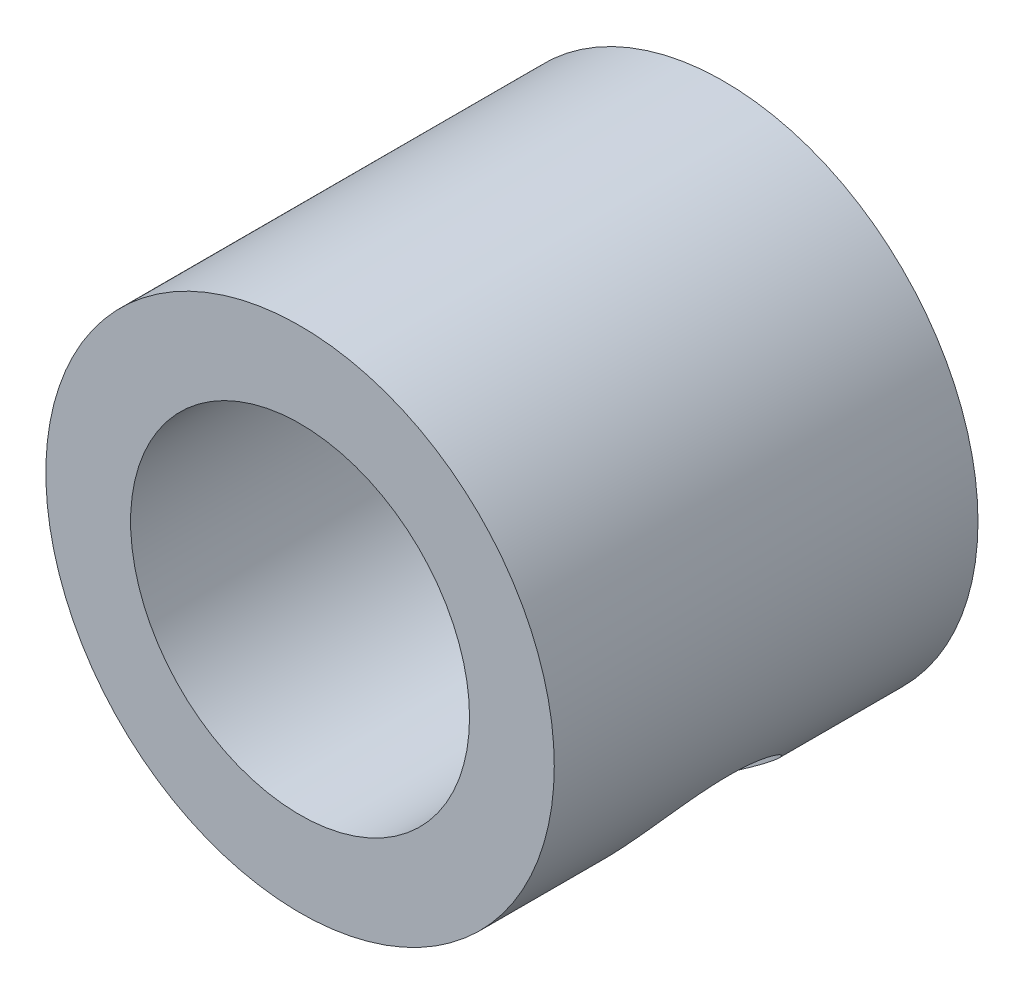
ISO-10303-21;
HEADER;
FILE_DESCRIPTION(('STEP AP214'),'2;1');
FILE_NAME('part.step','',(''),(''),'','','');
FILE_SCHEMA(('AUTOMOTIVE_DESIGN { 1 0 10303 214 1 1 1 1 }'));
ENDSEC;
DATA;
#1=APPLICATION_CONTEXT('core data for automotive mechanical design processes');
#2=APPLICATION_PROTOCOL_DEFINITION('international standard','automotive_design',2000,#1);
#3=PRODUCT_CONTEXT('',#1,'mechanical');
#4=PRODUCT('Part','Part','',(#3));
#5=PRODUCT_RELATED_PRODUCT_CATEGORY('part','',(#4));
#6=PRODUCT_DEFINITION_FORMATION('','',#4);
#7=PRODUCT_DEFINITION_CONTEXT('part definition',#1,'design');
#8=PRODUCT_DEFINITION('design','',#6,#7);
#9=PRODUCT_DEFINITION_SHAPE('','',#8);
#10=(LENGTH_UNIT() NAMED_UNIT(*) SI_UNIT(.MILLI.,.METRE.));
#11=(NAMED_UNIT(*) PLANE_ANGLE_UNIT() SI_UNIT($,.RADIAN.));
#12=(NAMED_UNIT(*) SI_UNIT($,.STERADIAN.) SOLID_ANGLE_UNIT());
#13=UNCERTAINTY_MEASURE_WITH_UNIT(LENGTH_MEASURE(1.E-05),#10,'distance_accuracy_value','');
#14=(GEOMETRIC_REPRESENTATION_CONTEXT(3) GLOBAL_UNCERTAINTY_ASSIGNED_CONTEXT((#13)) GLOBAL_UNIT_ASSIGNED_CONTEXT((#10,
#11,#12)) REPRESENTATION_CONTEXT('',''));
#15=CARTESIAN_POINT('',(0.,0.,0.));
#16=DIRECTION('',(0.,0.,1.));
#17=DIRECTION('',(1.,0.,0.));
#18=AXIS2_PLACEMENT_3D('',#15,#16,#17);
#19=CARTESIAN_POINT('',(0.,0.,5.));
#20=DIRECTION('',(0.,0.,1.));
#21=DIRECTION('',(1.,0.,0.));
#22=AXIS2_PLACEMENT_3D('',#19,#20,#21);
#23=PLANE('',#22);
#24=CARTESIAN_POINT('',(0.,0.,5.));
#25=DIRECTION('',(0.,0.,1.));
#26=DIRECTION('',(1.,0.,0.));
#27=AXIS2_PLACEMENT_3D('',#24,#25,#26);
#28=CIRCLE('',#27,3.);
#29=CARTESIAN_POINT('',(3.,0.,5.));
#30=VERTEX_POINT('',#29);
#31=EDGE_CURVE('E10',#30,#30,#28,.T.);
#32=ORIENTED_EDGE('',*,*,#31,.T.);
#33=EDGE_LOOP('',(#32));
#34=FACE_BOUND('',#33,.T.);
#35=CARTESIAN_POINT('',(0.,0.,5.));
#36=DIRECTION('',(0.,0.,1.));
#37=DIRECTION('',(1.,0.,0.));
#38=AXIS2_PLACEMENT_3D('',#35,#36,#37);
#39=CIRCLE('',#38,2.);
#40=CARTESIAN_POINT('',(2.,0.,5.));
#41=VERTEX_POINT('',#40);
#42=EDGE_CURVE('E49',#41,#41,#39,.T.);
#43=ORIENTED_EDGE('',*,*,#42,.F.);
#44=EDGE_LOOP('',(#43));
#45=FACE_BOUND('',#44,.T.);
#46=ADVANCED_FACE('F37',(#34,#45),#23,.T.);
#47=CARTESIAN_POINT('',(0.,0.,0.));
#48=DIRECTION('',(0.,0.,1.));
#49=DIRECTION('',(1.,0.,0.));
#50=AXIS2_PLACEMENT_3D('',#47,#48,#49);
#51=PLANE('',#50);
#52=CARTESIAN_POINT('',(0.,0.,0.));
#53=DIRECTION('',(0.,0.,1.));
#54=DIRECTION('',(1.,0.,0.));
#55=AXIS2_PLACEMENT_3D('',#52,#53,#54);
#56=CIRCLE('',#55,3.);
#57=CARTESIAN_POINT('',(3.,0.,0.));
#58=VERTEX_POINT('',#57);
#59=EDGE_CURVE('E42',#58,#58,#56,.T.);
#60=ORIENTED_EDGE('',*,*,#59,.F.);
#61=EDGE_LOOP('',(#60));
#62=FACE_BOUND('',#61,.T.);
#63=CARTESIAN_POINT('',(0.,0.,0.));
#64=DIRECTION('',(0.,0.,1.));
#65=DIRECTION('',(1.,0.,0.));
#66=AXIS2_PLACEMENT_3D('',#63,#64,#65);
#67=CIRCLE('',#66,2.);
#68=CARTESIAN_POINT('',(2.,0.,0.));
#69=VERTEX_POINT('',#68);
#70=EDGE_CURVE('E51',#69,#69,#67,.T.);
#71=ORIENTED_EDGE('',*,*,#70,.T.);
#72=EDGE_LOOP('',(#71));
#73=FACE_BOUND('',#72,.T.);
#74=ADVANCED_FACE('F80',(#62,#73),#51,.F.);
#75=CARTESIAN_POINT('',(0.,0.,5.));
#76=DIRECTION('',(0.,0.,-1.));
#77=DIRECTION('',(-1.,0.,0.));
#78=AXIS2_PLACEMENT_3D('',#75,#76,#77);
#79=CYLINDRICAL_SURFACE('',#78,3.);
#80=CARTESIAN_POINT('',(0.739618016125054,-2.90739835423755,2.5));
#81=CARTESIAN_POINT('',(0.739614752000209,-2.90739796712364,2.56101813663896));
#82=CARTESIAN_POINT('',(0.744813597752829,-2.9060911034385,2.62202056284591));
#83=CARTESIAN_POINT('',(0.76526503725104,-2.90077229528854,2.74218484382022));
#84=CARTESIAN_POINT('',(0.780517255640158,-2.89676045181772,2.80134676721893));
#85=CARTESIAN_POINT('',(0.820134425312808,-2.88579211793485,2.91606066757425));
#86=CARTESIAN_POINT('',(0.844477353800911,-2.87884273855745,2.97162099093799));
#87=CARTESIAN_POINT('',(0.901072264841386,-2.86163254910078,3.077995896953));
#88=CARTESIAN_POINT('',(0.933326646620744,-2.85137073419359,3.12880903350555));
#89=CARTESIAN_POINT('',(1.00603391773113,-2.8265587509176,3.22679720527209));
#90=CARTESIAN_POINT('',(1.04679376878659,-2.81183425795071,3.2737004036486));
#91=CARTESIAN_POINT('',(1.13393194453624,-2.77783794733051,3.36006599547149));
#92=CARTESIAN_POINT('',(1.18031147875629,-2.75856514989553,3.39952678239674));
#93=CARTESIAN_POINT('',(1.27873069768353,-2.71437871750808,3.47120041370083));
#94=CARTESIAN_POINT('',(1.33091019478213,-2.68929386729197,3.50311728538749));
#95=CARTESIAN_POINT('',(1.43760485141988,-2.63379963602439,3.55681558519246));
#96=CARTESIAN_POINT('',(1.49211918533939,-2.60339212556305,3.57860056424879));
#97=CARTESIAN_POINT('',(1.59906488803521,-2.53903811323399,3.61046181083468));
#98=CARTESIAN_POINT('',(1.6514837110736,-2.50530309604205,3.62100618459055));
#99=CARTESIAN_POINT('',(1.75478735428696,-2.43406097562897,3.63158729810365));
#100=CARTESIAN_POINT('',(1.805672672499,-2.39655511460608,3.63162748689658));
#101=CARTESIAN_POINT('',(1.90182338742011,-2.32091054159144,3.62147058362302));
#102=CARTESIAN_POINT('',(1.94724253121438,-2.28289694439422,3.61178457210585));
#103=CARTESIAN_POINT('',(2.0341504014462,-2.2058122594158,3.5833105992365));
#104=CARTESIAN_POINT('',(2.07563884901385,-2.16674109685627,3.56452199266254));
#105=CARTESIAN_POINT('',(2.15450923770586,-2.08835560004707,3.51814133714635));
#106=CARTESIAN_POINT('',(2.1918223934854,-2.0490460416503,3.49042478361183));
#107=CARTESIAN_POINT('',(2.26120944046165,-1.97221091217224,3.42708564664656));
#108=CARTESIAN_POINT('',(2.29328162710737,-1.93468592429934,3.39146049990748));
#109=CARTESIAN_POINT('',(2.35373048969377,-1.86074369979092,3.31085844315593));
#110=CARTESIAN_POINT('',(2.38177741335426,-1.82452249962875,3.26545373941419));
#111=CARTESIAN_POINT('',(2.43173192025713,-1.75739429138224,3.16782503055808));
#112=CARTESIAN_POINT('',(2.45363793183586,-1.7264886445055,3.11559928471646));
#113=CARTESIAN_POINT('',(2.49173867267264,-1.67104737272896,3.00429096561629));
#114=CARTESIAN_POINT('',(2.50779320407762,-1.64667141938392,2.9450801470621));
#115=CARTESIAN_POINT('',(2.53346804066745,-1.6068935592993,2.82240630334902));
#116=CARTESIAN_POINT('',(2.54309196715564,-1.59148660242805,2.75894569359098));
#117=CARTESIAN_POINT('',(2.55553564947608,-1.57142293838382,2.63334876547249));
#118=CARTESIAN_POINT('',(2.55870395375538,-1.56621616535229,2.57133498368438));
#119=CARTESIAN_POINT('',(2.55927681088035,-1.5652807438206,2.44721760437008));
#120=CARTESIAN_POINT('',(2.55668282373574,-1.56954969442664,2.38511403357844));
#121=CARTESIAN_POINT('',(2.54601068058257,-1.58679625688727,2.26571111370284));
#122=CARTESIAN_POINT('',(2.53820230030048,-1.59934512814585,2.20832436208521));
#123=CARTESIAN_POINT('',(2.51739757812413,-1.63189455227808,2.09669661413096));
#124=CARTESIAN_POINT('',(2.50440016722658,-1.65189664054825,2.04245626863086));
#125=CARTESIAN_POINT('',(2.47263536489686,-1.69909100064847,1.93638563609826));
#126=CARTESIAN_POINT('',(2.45366885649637,-1.72652598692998,1.88472338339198));
#127=CARTESIAN_POINT('',(2.41014616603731,-1.7867777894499,1.78721061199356));
#128=CARTESIAN_POINT('',(2.3855879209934,-1.81959659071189,1.74136224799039));
#129=CARTESIAN_POINT('',(2.32913562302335,-1.89138568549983,1.65372970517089));
#130=CARTESIAN_POINT('',(2.29687224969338,-1.93061544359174,1.61239442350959));
#131=CARTESIAN_POINT('',(2.22617301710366,-2.0117266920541,1.53852022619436));
#132=CARTESIAN_POINT('',(2.18773712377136,-2.05360819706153,1.50598135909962));
#133=CARTESIAN_POINT('',(2.1052527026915,-2.13807862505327,1.4508321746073));
#134=CARTESIAN_POINT('',(2.06122293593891,-2.18066478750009,1.42818974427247));
#135=CARTESIAN_POINT('',(1.96832006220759,-2.26487041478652,1.39356794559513));
#136=CARTESIAN_POINT('',(1.91944926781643,-2.30649032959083,1.38158351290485));
#137=CARTESIAN_POINT('',(1.82119250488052,-2.3847369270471,1.36916783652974));
#138=CARTESIAN_POINT('',(1.77200560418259,-2.42151331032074,1.36809901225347));
#139=CARTESIAN_POINT('',(1.67199773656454,-2.49161613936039,1.37590184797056));
#140=CARTESIAN_POINT('',(1.62117697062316,-2.52494300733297,1.38477228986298));
#141=CARTESIAN_POINT('',(1.52080704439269,-2.58660650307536,1.41175350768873));
#142=CARTESIAN_POINT('',(1.47125761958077,-2.61504643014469,1.42962955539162));
#143=CARTESIAN_POINT('',(1.37368715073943,-2.66759393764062,1.47387995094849));
#144=CARTESIAN_POINT('',(1.32566639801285,-2.69170069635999,1.50025590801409));
#145=CARTESIAN_POINT('',(1.23064805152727,-2.73649065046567,1.5620233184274));
#146=CARTESIAN_POINT('',(1.18377922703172,-2.75698636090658,1.59774835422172));
#147=CARTESIAN_POINT('',(1.09482759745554,-2.79350469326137,1.67667557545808));
#148=CARTESIAN_POINT('',(1.05274651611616,-2.8095257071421,1.71988043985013));
#149=CARTESIAN_POINT('',(0.972780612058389,-2.8382388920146,1.81528319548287));
#150=CARTESIAN_POINT('',(0.935239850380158,-2.85070762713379,1.86783810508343));
#151=CARTESIAN_POINT('',(0.868824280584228,-2.87164788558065,1.97890925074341));
#152=CARTESIAN_POINT('',(0.839950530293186,-2.88011892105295,2.03742621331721));
#153=CARTESIAN_POINT('',(0.791313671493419,-2.89387269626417,2.16181258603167));
#154=CARTESIAN_POINT('',(0.772053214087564,-2.89898327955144,2.22789991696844));
#155=CARTESIAN_POINT('',(0.746211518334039,-2.90574515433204,2.36266598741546));
#156=CARTESIAN_POINT('',(0.739621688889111,-2.90739878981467,2.43134293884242));
#157=CARTESIAN_POINT('',(0.739618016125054,-2.90739835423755,2.5));
#158=B_SPLINE_CURVE_WITH_KNOTS('',3,(#80,#81,#82,#83,#84,#85,#86,#87,#88,#89,#90,#91,#92,#93,
#94,#95,#96,#97,#98,#99,#100,#101,#102,#103,#104,#105,#106,#107,#108,#109,#110,#111,#112,#113,
#114,#115,#116,#117,#118,#119,#120,#121,#122,#123,#124,#125,#126,#127,#128,#129,#130,#131,#132,
#133,#134,#135,#136,#137,#138,#139,#140,#141,#142,#143,#144,#145,#146,#147,#148,#149,#150,#151,
#152,#153,#154,#155,#156,#157),.UNSPECIFIED.,.T.,.F.,(4,2,2,2,2,2,2,2,2,2,2,2,2,2,2,2,2,2,2,2,2,
2,2,2,2,2,2,2,2,2,2,2,2,2,2,2,2,2,4),(0.,0.182798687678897,0.365590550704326,0.547942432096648,
0.730349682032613,0.921080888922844,1.11185322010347,1.30918710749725,1.5064517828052,
1.69513544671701,1.88375715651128,2.06296037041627,2.24217628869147,2.4240083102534,
2.60589935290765,2.79852376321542,2.99119742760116,3.18822362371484,3.38513877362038,
3.57110586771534,3.75702584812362,3.93400354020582,4.11101771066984,4.29470759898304,
4.47846536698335,4.67400202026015,4.86953975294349,5.06443818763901,5.25924396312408,
5.44260114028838,5.62593584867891,5.80472173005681,5.98354147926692,6.16991005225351,
6.35634551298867,6.5527362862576,6.74915101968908,6.95497407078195,7.16065751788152),.UNSPECIFIED.);
#159=CARTESIAN_POINT('',(0.739618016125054,-2.90739835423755,2.5));
#160=VERTEX_POINT('',#159);
#161=EDGE_CURVE('E63',#160,#160,#158,.T.);
#162=ORIENTED_EDGE('',*,*,#161,.T.);
#163=EDGE_LOOP('',(#162));
#164=FACE_BOUND('',#163,.T.);
#165=ORIENTED_EDGE('',*,*,#31,.F.);
#166=EDGE_LOOP('',(#165));
#167=FACE_BOUND('',#166,.T.);
#168=ORIENTED_EDGE('',*,*,#59,.T.);
#169=EDGE_LOOP('',(#168));
#170=FACE_BOUND('',#169,.T.);
#171=ADVANCED_FACE('F39',(#164,#167,#170),#79,.T.);
#172=CARTESIAN_POINT('',(0.,0.,5.));
#173=DIRECTION('',(0.,0.,-1.));
#174=DIRECTION('',(-1.,0.,0.));
#175=AXIS2_PLACEMENT_3D('',#172,#173,#174);
#176=CYLINDRICAL_SURFACE('',#175,2.);
#177=CARTESIAN_POINT('',(1.18701667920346,-1.60965567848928,1.3697));
#178=CARTESIAN_POINT('',(1.13991848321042,-1.64439104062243,1.36969679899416));
#179=CARTESIAN_POINT('',(1.09129449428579,-1.67702691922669,1.37426400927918));
#180=CARTESIAN_POINT('',(0.992602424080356,-1.73726270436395,1.39227455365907));
#181=CARTESIAN_POINT('',(0.942534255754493,-1.76486230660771,1.40571842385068));
#182=CARTESIAN_POINT('',(0.842829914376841,-1.81458943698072,1.44076733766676));
#183=CARTESIAN_POINT('',(0.793192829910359,-1.83673670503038,1.46234220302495));
#184=CARTESIAN_POINT('',(0.695663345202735,-1.87585097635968,1.51282994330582));
#185=CARTESIAN_POINT('',(0.647771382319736,-1.89281668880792,1.54174464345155));
#186=CARTESIAN_POINT('',(0.55175887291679,-1.92308937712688,1.60839035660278));
#187=CARTESIAN_POINT('',(0.503863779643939,-1.93605081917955,1.64660175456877));
#188=CARTESIAN_POINT('',(0.413046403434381,-1.95744063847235,1.72969609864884));
#189=CARTESIAN_POINT('',(0.370129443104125,-1.96586419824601,1.7745860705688));
#190=CARTESIAN_POINT('',(0.286643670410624,-1.97985078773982,1.87538949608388));
#191=CARTESIAN_POINT('',(0.246803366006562,-1.98501701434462,1.93196670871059));
#192=CARTESIAN_POINT('',(0.177579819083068,-1.99240663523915,2.05135556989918));
#193=CARTESIAN_POINT('',(0.148181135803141,-1.99463438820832,2.11415783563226));
#194=CARTESIAN_POINT('',(0.1073801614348,-1.99719632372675,2.23026014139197));
#195=CARTESIAN_POINT('',(0.0934578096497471,-1.99783636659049,2.28266758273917));
#196=CARTESIAN_POINT('',(0.0746489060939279,-1.99862958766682,2.3890661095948));
#197=CARTESIAN_POINT('',(0.0697529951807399,-1.99878327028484,2.4430554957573));
#198=CARTESIAN_POINT('',(0.0694116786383,-1.99879514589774,2.55113035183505));
#199=CARTESIAN_POINT('',(0.0739781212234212,-1.99865296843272,2.60521585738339));
#200=CARTESIAN_POINT('',(0.0921805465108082,-1.99789445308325,2.7118432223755));
#201=CARTESIAN_POINT('',(0.105822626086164,-1.99727779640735,2.76438401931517));
#202=CARTESIAN_POINT('',(0.141098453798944,-1.99509367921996,2.86652042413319));
#203=CARTESIAN_POINT('',(0.162714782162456,-1.9935282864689,2.91612218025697));
#204=CARTESIAN_POINT('',(0.212689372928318,-1.98881671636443,3.01170485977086));
#205=CARTESIAN_POINT('',(0.241050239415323,-1.98566992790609,3.05768437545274));
#206=CARTESIAN_POINT('',(0.308215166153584,-1.97644202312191,3.15237991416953));
#207=CARTESIAN_POINT('',(0.347959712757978,-1.96997781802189,3.20039243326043));
#208=CARTESIAN_POINT('',(0.433262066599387,-1.95299204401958,3.29017349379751));
#209=CARTESIAN_POINT('',(0.478824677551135,-1.94246710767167,3.33193681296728));
#210=CARTESIAN_POINT('',(0.579473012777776,-1.91499761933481,3.4125979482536));
#211=CARTESIAN_POINT('',(0.635055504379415,-1.89747917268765,3.45068954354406));
#212=CARTESIAN_POINT('',(0.74938135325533,-1.85529774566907,3.51689403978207));
#213=CARTESIAN_POINT('',(0.808122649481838,-1.83063937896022,3.54501335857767));
#214=CARTESIAN_POINT('',(0.922187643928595,-1.77575043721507,3.58831733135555));
#215=CARTESIAN_POINT('',(0.977462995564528,-1.74603026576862,3.60426915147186));
#216=CARTESIAN_POINT('',(1.08637151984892,-1.68042374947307,3.62541321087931));
#217=CARTESIAN_POINT('',(1.14000619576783,-1.64454326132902,3.63061560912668));
#218=CARTESIAN_POINT('',(1.23734270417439,-1.57232904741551,3.62999306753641));
#219=CARTESIAN_POINT('',(1.28146947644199,-1.53654947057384,3.6253980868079));
#220=CARTESIAN_POINT('',(1.36558980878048,-1.46229649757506,3.60785093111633));
#221=CARTESIAN_POINT('',(1.40558327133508,-1.42382303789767,3.59489855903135));
#222=CARTESIAN_POINT('',(1.4803920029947,-1.34586048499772,3.56135522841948));
#223=CARTESIAN_POINT('',(1.5152440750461,-1.30638124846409,3.54082265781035));
#224=CARTESIAN_POINT('',(1.57984885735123,-1.22746952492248,3.49285297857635));
#225=CARTESIAN_POINT('',(1.60960028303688,-1.18803705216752,3.46541413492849));
#226=CARTESIAN_POINT('',(1.66687405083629,-1.10646507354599,3.40119526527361));
#227=CARTESIAN_POINT('',(1.69384452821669,-1.0644693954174,3.36374129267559));
#228=CARTESIAN_POINT('',(1.74198866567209,-0.983712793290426,3.28213997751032));
#229=CARTESIAN_POINT('',(1.76315570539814,-0.944955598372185,3.23798507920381));
#230=CARTESIAN_POINT('',(1.80212833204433,-0.868540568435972,3.13863863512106));
#231=CARTESIAN_POINT('',(1.81932979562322,-0.831446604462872,3.08277127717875));
#232=CARTESIAN_POINT('',(1.84780557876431,-0.766088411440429,2.96472698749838));
#233=CARTESIAN_POINT('',(1.85908801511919,-0.737812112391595,2.90255883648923));
#234=CARTESIAN_POINT('',(1.87445670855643,-0.697690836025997,2.78710365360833));
#235=CARTESIAN_POINT('',(1.87956054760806,-0.683634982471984,2.73472119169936));
#236=CARTESIAN_POINT('',(1.88659199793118,-0.663990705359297,2.62820283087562));
#237=CARTESIAN_POINT('',(1.88852304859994,-0.658393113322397,2.57406889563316));
#238=CARTESIAN_POINT('',(1.88928222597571,-0.656212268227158,2.46550429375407));
#239=CARTESIAN_POINT('',(1.88810509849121,-0.659644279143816,2.41107328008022));
#240=CARTESIAN_POINT('',(1.88259637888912,-0.675200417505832,2.30362303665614));
#241=CARTESIAN_POINT('',(1.87826277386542,-0.687330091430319,2.25060473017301));
#242=CARTESIAN_POINT('',(1.86636614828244,-0.71899646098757,2.14792192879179));
#243=CARTESIAN_POINT('',(1.85884052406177,-0.738447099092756,2.0982260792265));
#244=CARTESIAN_POINT('',(1.84034330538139,-0.783406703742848,2.00235882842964));
#245=CARTESIAN_POINT('',(1.82937041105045,-0.80891795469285,1.95618876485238));
#246=CARTESIAN_POINT('',(1.80172253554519,-0.868933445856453,1.8611694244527));
#247=CARTESIAN_POINT('',(1.78443208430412,-0.90421637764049,1.8129906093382));
#248=CARTESIAN_POINT('',(1.74439287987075,-0.97923640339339,1.72271377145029));
#249=CARTESIAN_POINT('',(1.7216396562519,-1.01897713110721,1.68062077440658));
#250=CARTESIAN_POINT('',(1.66722243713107,-1.10602746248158,1.59877123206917));
#251=CARTESIAN_POINT('',(1.63483032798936,-1.1536800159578,1.55985422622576));
#252=CARTESIAN_POINT('',(1.56231233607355,-1.25012504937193,1.49183459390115));
#253=CARTESIAN_POINT('',(1.5221898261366,-1.2989170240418,1.46272770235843));
#254=CARTESIAN_POINT('',(1.43596591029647,-1.39353911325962,1.41653533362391));
#255=CARTESIAN_POINT('',(1.39012015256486,-1.43941326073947,1.39906790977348));
#256=CARTESIAN_POINT('',(1.29251325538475,-1.52765229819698,1.37565799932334));
#257=CARTESIAN_POINT('',(1.24075826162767,-1.57002075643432,1.36970365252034));
#258=CARTESIAN_POINT('',(1.18701667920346,-1.60965567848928,1.3697));
#259=B_SPLINE_CURVE_WITH_KNOTS('',3,(#177,#178,#179,#180,#181,#182,#183,#184,#185,#186,#187,
#188,#189,#190,#191,#192,#193,#194,#195,#196,#197,#198,#199,#200,#201,#202,#203,#204,#205,#206,
#207,#208,#209,#210,#211,#212,#213,#214,#215,#216,#217,#218,#219,#220,#221,#222,#223,#224,#225,
#226,#227,#228,#229,#230,#231,#232,#233,#234,#235,#236,#237,#238,#239,#240,#241,#242,#243,#244,
#245,#246,#247,#248,#249,#250,#251,#252,#253,#254,#255,#256,#257,#258),.UNSPECIFIED.,.T.,.F.,(4,
2,2,2,2,2,2,2,2,2,2,2,2,2,2,2,2,2,2,2,2,2,2,2,2,2,2,2,2,2,2,2,2,2,2,2,2,2,2,2,4),(0.,
0.175306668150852,0.350623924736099,0.525296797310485,0.700013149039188,0.88714125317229,
1.07446762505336,1.28160783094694,1.48844043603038,1.65042200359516,1.8122355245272,
1.9742517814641,2.13637698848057,2.29815010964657,2.45998579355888,2.64722672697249,
2.83462326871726,3.04240986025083,3.250062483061,3.44319039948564,3.63613571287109,
3.80629041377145,3.97644912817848,4.14532361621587,4.31424057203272,4.50068971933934,
4.6873506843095,4.89403416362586,5.10043347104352,5.26315556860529,5.425701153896,
5.5885216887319,5.75144614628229,5.91251239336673,6.07363944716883,6.25941311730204,
6.44533933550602,6.65286535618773,6.86030103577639,7.06054178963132,7.26057615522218),.UNSPECIFIED.);
#260=CARTESIAN_POINT('',(1.18701667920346,-1.60965567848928,1.3697));
#261=VERTEX_POINT('',#260);
#262=EDGE_CURVE('E54',#261,#261,#259,.T.);
#263=ORIENTED_EDGE('',*,*,#262,.F.);
#264=EDGE_LOOP('',(#263));
#265=FACE_BOUND('',#264,.T.);
#266=ORIENTED_EDGE('',*,*,#42,.T.);
#267=EDGE_LOOP('',(#266));
#268=FACE_BOUND('',#267,.T.);
#269=ORIENTED_EDGE('',*,*,#70,.F.);
#270=EDGE_LOOP('',(#269));
#271=FACE_BOUND('',#270,.T.);
#272=ADVANCED_FACE('F71',(#265,#268,#271),#176,.F.);
#273=CARTESIAN_POINT('',(1.18701667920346,-1.60965567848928,2.5));
#274=DIRECTION('',(-0.59350833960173,0.804827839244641,0.));
#275=DIRECTION('',(-0.804827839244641,-0.59350833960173,0.));
#276=AXIS2_PLACEMENT_3D('',#273,#274,#275);
#277=CYLINDRICAL_SURFACE('',#276,1.1303);
#278=ORIENTED_EDGE('',*,*,#262,.T.);
#279=EDGE_LOOP('',(#278));
#280=FACE_BOUND('',#279,.T.);
#281=ORIENTED_EDGE('',*,*,#161,.F.);
#282=EDGE_LOOP('',(#281));
#283=FACE_BOUND('',#282,.T.);
#284=ADVANCED_FACE('F68',(#280,#283),#277,.F.);
#285=CLOSED_SHELL('',(#46,#74,#171,#272,#284));
#286=MANIFOLD_SOLID_BREP('B2',#285);
#287=ADVANCED_BREP_SHAPE_REPRESENTATION('',(#18,#286),#14);
#288=SHAPE_DEFINITION_REPRESENTATION(#9,#287);
ENDSEC;
END-ISO-10303-21;
